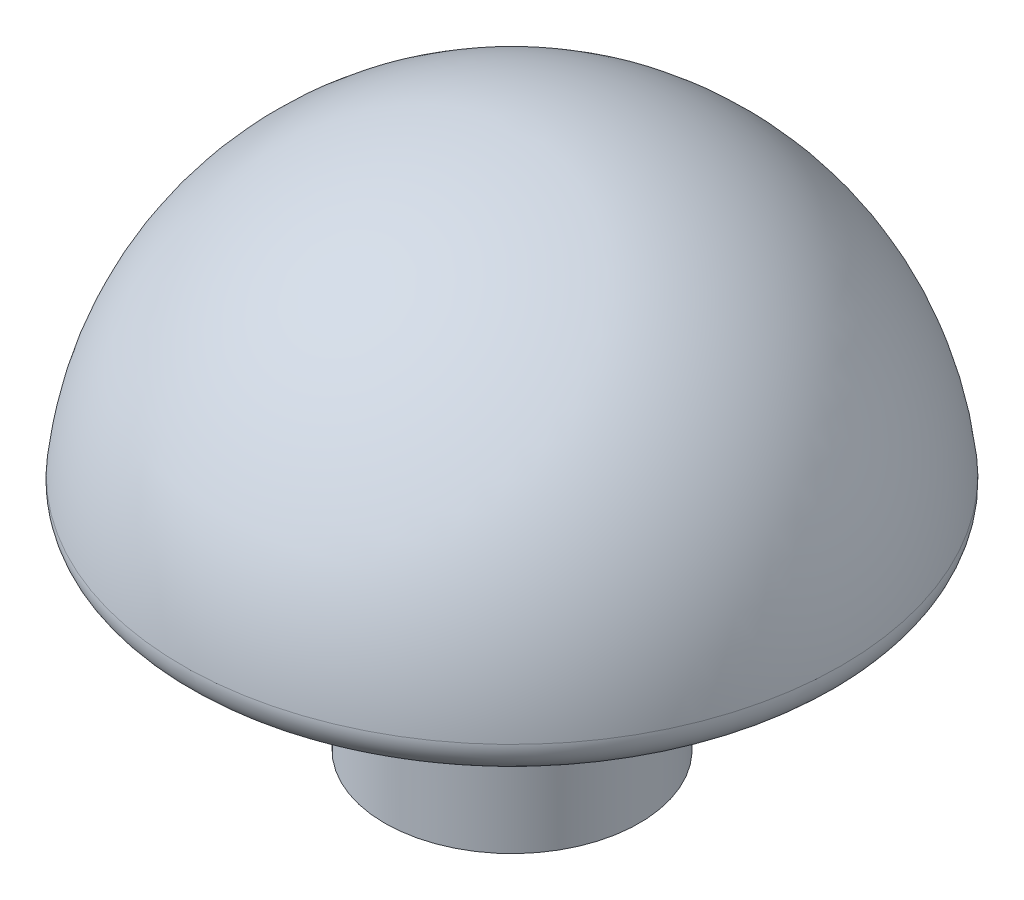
ISO-10303-21;
HEADER;
FILE_DESCRIPTION(('STEP AP214'),'2;1');
FILE_NAME('part.step','',(''),(''),'','','');
FILE_SCHEMA(('AUTOMOTIVE_DESIGN { 1 0 10303 214 1 1 1 1 }'));
ENDSEC;
DATA;
#1=APPLICATION_CONTEXT('core data for automotive mechanical design processes');
#2=APPLICATION_PROTOCOL_DEFINITION('international standard','automotive_design',2000,#1);
#3=PRODUCT_CONTEXT('',#1,'mechanical');
#4=PRODUCT('Part','Part','',(#3));
#5=PRODUCT_RELATED_PRODUCT_CATEGORY('part','',(#4));
#6=PRODUCT_DEFINITION_FORMATION('','',#4);
#7=PRODUCT_DEFINITION_CONTEXT('part definition',#1,'design');
#8=PRODUCT_DEFINITION('design','',#6,#7);
#9=PRODUCT_DEFINITION_SHAPE('','',#8);
#10=(LENGTH_UNIT() NAMED_UNIT(*) SI_UNIT(.MILLI.,.METRE.));
#11=(NAMED_UNIT(*) PLANE_ANGLE_UNIT() SI_UNIT($,.RADIAN.));
#12=(NAMED_UNIT(*) SI_UNIT($,.STERADIAN.) SOLID_ANGLE_UNIT());
#13=UNCERTAINTY_MEASURE_WITH_UNIT(LENGTH_MEASURE(1.E-05),#10,'distance_accuracy_value','');
#14=(GEOMETRIC_REPRESENTATION_CONTEXT(3) GLOBAL_UNCERTAINTY_ASSIGNED_CONTEXT((#13)) GLOBAL_UNIT_ASSIGNED_CONTEXT((#10,
#11,#12)) REPRESENTATION_CONTEXT('',''));
#15=CARTESIAN_POINT('',(0.,0.,0.));
#16=DIRECTION('',(0.,0.,1.));
#17=DIRECTION('',(1.,0.,0.));
#18=AXIS2_PLACEMENT_3D('',#15,#16,#17);
#19=CARTESIAN_POINT('',(0.,0.,0.));
#20=DIRECTION('',(0.,1.,0.));
#21=DIRECTION('',(0.,0.,1.));
#22=AXIS2_PLACEMENT_3D('',#19,#20,#21);
#23=PLANE('',#22);
#24=CARTESIAN_POINT('',(0.,0.,0.));
#25=DIRECTION('',(0.,1.,0.));
#26=DIRECTION('',(0.,0.,1.));
#27=AXIS2_PLACEMENT_3D('',#24,#25,#26);
#28=CIRCLE('',#27,12.5);
#29=CARTESIAN_POINT('',(0.,0.,12.5));
#30=VERTEX_POINT('',#29);
#31=EDGE_CURVE('E71',#30,#30,#28,.T.);
#32=ORIENTED_EDGE('',*,*,#31,.F.);
#33=EDGE_LOOP('',(#32));
#34=FACE_BOUND('',#33,.T.);
#35=CARTESIAN_POINT('',(0.,0.,0.));
#36=DIRECTION('',(0.,1.,0.));
#37=DIRECTION('',(0.,0.,1.));
#38=AXIS2_PLACEMENT_3D('',#35,#36,#37);
#39=CIRCLE('',#38,7.5);
#40=CARTESIAN_POINT('',(4.5,0.,-6.));
#41=VERTEX_POINT('',#40);
#42=CARTESIAN_POINT('',(4.5,0.,6.));
#43=VERTEX_POINT('',#42);
#44=EDGE_CURVE('E48',#41,#43,#39,.T.);
#45=ORIENTED_EDGE('',*,*,#44,.T.);
#46=DIRECTION('',(0.,0.,-1.));
#47=VECTOR('',#46,1.);
#48=CARTESIAN_POINT('',(4.5,0.,-6.));
#49=LINE('',#48,#47);
#50=EDGE_CURVE('E70',#43,#41,#49,.T.);
#51=ORIENTED_EDGE('',*,*,#50,.T.);
#52=EDGE_LOOP('',(#45,#51));
#53=FACE_BOUND('',#52,.T.);
#54=ADVANCED_FACE('F33',(#34,#53),#23,.F.);
#55=CARTESIAN_POINT('',(0.,20.,0.));
#56=DIRECTION('',(0.,-1.,0.));
#57=DIRECTION('',(0.,0.,-1.));
#58=AXIS2_PLACEMENT_3D('',#55,#56,#57);
#59=CYLINDRICAL_SURFACE('',#58,12.5);
#60=CARTESIAN_POINT('',(0.,17.,0.));
#61=DIRECTION('',(0.,-1.,0.));
#62=DIRECTION('',(0.,0.,-1.));
#63=AXIS2_PLACEMENT_3D('',#60,#61,#62);
#64=CIRCLE('',#63,12.5);
#65=CARTESIAN_POINT('',(0.,17.,-12.5));
#66=VERTEX_POINT('',#65);
#67=EDGE_CURVE('E41',#66,#66,#64,.T.);
#68=ORIENTED_EDGE('',*,*,#67,.T.);
#69=EDGE_LOOP('',(#68));
#70=FACE_BOUND('',#69,.T.);
#71=ORIENTED_EDGE('',*,*,#31,.T.);
#72=EDGE_LOOP('',(#71));
#73=FACE_BOUND('',#72,.T.);
#74=ADVANCED_FACE('F35',(#70,#73),#59,.T.);
#75=CARTESIAN_POINT('',(0.,20.,0.));
#76=DIRECTION('',(0.,-1.,0.));
#77=DIRECTION('',(0.,0.,-1.));
#78=AXIS2_PLACEMENT_3D('',#75,#76,#77);
#79=CYLINDRICAL_SURFACE('',#78,7.5);
#80=ORIENTED_EDGE('',*,*,#44,.F.);
#81=DIRECTION('',(0.,-1.,0.));
#82=VECTOR('',#81,1.);
#83=CARTESIAN_POINT('',(4.5,20.,-6.));
#84=LINE('',#83,#82);
#85=CARTESIAN_POINT('',(4.5,20.,-6.));
#86=VERTEX_POINT('',#85);
#87=EDGE_CURVE('E65',#86,#41,#84,.T.);
#88=ORIENTED_EDGE('',*,*,#87,.F.);
#89=CARTESIAN_POINT('',(0.,20.,0.));
#90=DIRECTION('',(0.,1.,0.));
#91=DIRECTION('',(0.,0.,1.));
#92=AXIS2_PLACEMENT_3D('',#89,#90,#91);
#93=CIRCLE('',#92,7.5);
#94=CARTESIAN_POINT('',(4.5,20.,6.));
#95=VERTEX_POINT('',#94);
#96=EDGE_CURVE('E55',#86,#95,#93,.T.);
#97=ORIENTED_EDGE('',*,*,#96,.T.);
#98=DIRECTION('',(0.,-1.,0.));
#99=VECTOR('',#98,1.);
#100=CARTESIAN_POINT('',(4.5,20.,6.));
#101=LINE('',#100,#99);
#102=EDGE_CURVE('E67',#95,#43,#101,.T.);
#103=ORIENTED_EDGE('',*,*,#102,.T.);
#104=EDGE_LOOP('',(#80,#88,#97,#103));
#105=FACE_BOUND('',#104,.T.);
#106=ADVANCED_FACE('F73',(#105),#79,.F.);
#107=CARTESIAN_POINT('',(4.5,20.,-6.));
#108=DIRECTION('',(-1.,0.,0.));
#109=DIRECTION('',(0.,0.,1.));
#110=AXIS2_PLACEMENT_3D('',#107,#108,#109);
#111=PLANE('',#110);
#112=ORIENTED_EDGE('',*,*,#50,.F.);
#113=ORIENTED_EDGE('',*,*,#102,.F.);
#114=DIRECTION('',(0.,0.,-1.));
#115=VECTOR('',#114,1.);
#116=CARTESIAN_POINT('',(4.5,20.,-6.));
#117=LINE('',#116,#115);
#118=EDGE_CURVE('E61',#95,#86,#117,.T.);
#119=ORIENTED_EDGE('',*,*,#118,.T.);
#120=ORIENTED_EDGE('',*,*,#87,.T.);
#121=EDGE_LOOP('',(#112,#113,#119,#120));
#122=FACE_BOUND('',#121,.T.);
#123=ADVANCED_FACE('F68',(#122),#111,.T.);
#124=CARTESIAN_POINT('',(32.5,20.,0.));
#125=DIRECTION('',(0.,-1.,0.));
#126=DIRECTION('',(0.,0.,-1.));
#127=AXIS2_PLACEMENT_3D('',#124,#125,#126);
#128=PLANE('',#127);
#129=ORIENTED_EDGE('',*,*,#118,.F.);
#130=ORIENTED_EDGE('',*,*,#96,.F.);
#131=EDGE_LOOP('',(#129,#130));
#132=FACE_BOUND('',#131,.T.);
#133=ADVANCED_FACE('F63',(#132),#128,.T.);
#134=CARTESIAN_POINT('',(0.,20.,0.));
#135=DIRECTION('',(0.,-1.,0.));
#136=DIRECTION('',(0.,0.,-1.));
#137=AXIS2_PLACEMENT_3D('',#134,#135,#136);
#138=CIRCLE('',#137,15.5);
#139=CARTESIAN_POINT('',(0.,20.,-15.5));
#140=VERTEX_POINT('',#139);
#141=EDGE_CURVE('E84',#140,#140,#138,.F.);
#142=ORIENTED_EDGE('',*,*,#141,.T.);
#143=EDGE_LOOP('',(#142));
#144=FACE_BOUND('',#143,.T.);
#145=CARTESIAN_POINT('',(0.,20.,0.));
#146=DIRECTION('',(0.,-1.,0.));
#147=DIRECTION('',(0.,0.,-1.));
#148=AXIS2_PLACEMENT_3D('',#145,#146,#147);
#149=CIRCLE('',#148,29.3470611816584);
#150=CARTESIAN_POINT('',(0.,20.,-29.3470611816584));
#151=VERTEX_POINT('',#150);
#152=EDGE_CURVE('E81',#151,#151,#149,.T.);
#153=ORIENTED_EDGE('',*,*,#152,.T.);
#154=EDGE_LOOP('',(#153));
#155=FACE_BOUND('',#154,.T.);
#156=ADVANCED_FACE('F99',(#144,#155),#128,.T.);
#157=CARTESIAN_POINT('',(0.,20.,0.));
#158=DIRECTION('',(0.,-1.,0.));
#159=DIRECTION('',(1.,0.,0.));
#160=AXIS2_PLACEMENT_3D('',#157,#158,#159);
#161=SPHERICAL_SURFACE('',#160,32.5);
#162=CARTESIAN_POINT('',(0.,23.3050847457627,0.));
#163=DIRECTION('',(0.,-1.,0.));
#164=DIRECTION('',(0.,0.,-1.));
#165=AXIS2_PLACEMENT_3D('',#162,#163,#164);
#166=CIRCLE('',#165,32.331508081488);
#167=CARTESIAN_POINT('',(0.,23.3050847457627,-32.331508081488));
#168=VERTEX_POINT('',#167);
#169=EDGE_CURVE('E11',#168,#168,#166,.F.);
#170=ORIENTED_EDGE('',*,*,#169,.T.);
#171=EDGE_LOOP('',(#170));
#172=FACE_BOUND('',#171,.T.);
#173=ADVANCED_FACE('F95',(#172),#161,.T.);
#174=CARTESIAN_POINT('',(0.,17.,0.));
#175=DIRECTION('',(0.,-1.,0.));
#176=DIRECTION('',(0.,0.,-1.));
#177=AXIS2_PLACEMENT_3D('',#174,#175,#176);
#178=TOROIDAL_SURFACE('',#177,15.5,3.);
#179=ORIENTED_EDGE('',*,*,#67,.F.);
#180=EDGE_LOOP('',(#179));
#181=FACE_BOUND('',#180,.T.);
#182=ORIENTED_EDGE('',*,*,#141,.F.);
#183=EDGE_LOOP('',(#182));
#184=FACE_BOUND('',#183,.T.);
#185=ADVANCED_FACE('F91',(#181,#184),#178,.F.);
#186=CARTESIAN_POINT('',(0.,23.,0.));
#187=DIRECTION('',(0.,-1.,0.));
#188=DIRECTION('',(0.,0.,-1.));
#189=AXIS2_PLACEMENT_3D('',#186,#187,#188);
#190=TOROIDAL_SURFACE('',#189,29.3470611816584,3.);
#191=ORIENTED_EDGE('',*,*,#169,.F.);
#192=EDGE_LOOP('',(#191));
#193=FACE_BOUND('',#192,.T.);
#194=ORIENTED_EDGE('',*,*,#152,.F.);
#195=EDGE_LOOP('',(#194));
#196=FACE_BOUND('',#195,.T.);
#197=ADVANCED_FACE('F94',(#193,#196),#190,.T.);
#198=CLOSED_SHELL('',(#54,#74,#106,#123,#133,#156,#173,#185,#197));
#199=MANIFOLD_SOLID_BREP('B2',#198);
#200=ADVANCED_BREP_SHAPE_REPRESENTATION('',(#18,#199),#14);
#201=SHAPE_DEFINITION_REPRESENTATION(#9,#200);
ENDSEC;
END-ISO-10303-21;
